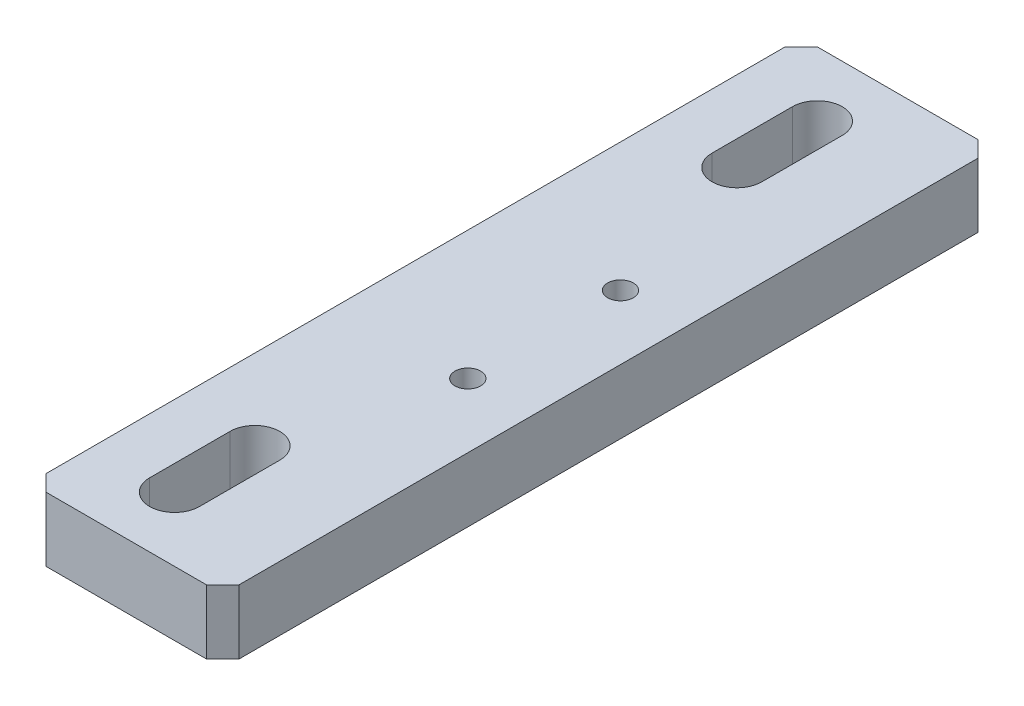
ISO-10303-21;
HEADER;
FILE_DESCRIPTION(('STEP AP214'),'2;1');
FILE_NAME('part.step','',(''),(''),'','','');
FILE_SCHEMA(('AUTOMOTIVE_DESIGN { 1 0 10303 214 1 1 1 1 }'));
ENDSEC;
DATA;
#1=APPLICATION_CONTEXT('core data for automotive mechanical design processes');
#2=APPLICATION_PROTOCOL_DEFINITION('international standard','automotive_design',2000,#1);
#3=PRODUCT_CONTEXT('',#1,'mechanical');
#4=PRODUCT('Part','Part','',(#3));
#5=PRODUCT_RELATED_PRODUCT_CATEGORY('part','',(#4));
#6=PRODUCT_DEFINITION_FORMATION('','',#4);
#7=PRODUCT_DEFINITION_CONTEXT('part definition',#1,'design');
#8=PRODUCT_DEFINITION('design','',#6,#7);
#9=PRODUCT_DEFINITION_SHAPE('','',#8);
#10=(LENGTH_UNIT() NAMED_UNIT(*) SI_UNIT(.MILLI.,.METRE.));
#11=(NAMED_UNIT(*) PLANE_ANGLE_UNIT() SI_UNIT($,.RADIAN.));
#12=(NAMED_UNIT(*) SI_UNIT($,.STERADIAN.) SOLID_ANGLE_UNIT());
#13=UNCERTAINTY_MEASURE_WITH_UNIT(LENGTH_MEASURE(1.E-05),#10,'distance_accuracy_value','');
#14=(GEOMETRIC_REPRESENTATION_CONTEXT(3) GLOBAL_UNCERTAINTY_ASSIGNED_CONTEXT((#13)) GLOBAL_UNIT_ASSIGNED_CONTEXT((#10,
#11,#12)) REPRESENTATION_CONTEXT('',''));
#15=CARTESIAN_POINT('',(0.,0.,0.));
#16=DIRECTION('',(0.,0.,1.));
#17=DIRECTION('',(1.,0.,0.));
#18=AXIS2_PLACEMENT_3D('',#15,#16,#17);
#19=CARTESIAN_POINT('',(0.,4.,0.));
#20=DIRECTION('',(0.,1.,0.));
#21=DIRECTION('',(0.,0.,1.));
#22=AXIS2_PLACEMENT_3D('',#19,#20,#21);
#23=PLANE('',#22);
#24=CARTESIAN_POINT('',(8.,4.,-4.75000000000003));
#25=DIRECTION('',(0.,1.,0.));
#26=DIRECTION('',(0.,0.,1.));
#27=AXIS2_PLACEMENT_3D('',#24,#25,#26);
#28=CIRCLE('',#27,0.799999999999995);
#29=CARTESIAN_POINT('',(8.,4.,-3.95000000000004));
#30=VERTEX_POINT('',#29);
#31=EDGE_CURVE('E523',#30,#30,#28,.T.);
#32=ORIENTED_EDGE('',*,*,#31,.F.);
#33=EDGE_LOOP('',(#32));
#34=FACE_BOUND('',#33,.T.);
#35=CARTESIAN_POINT('',(7.99999999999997,4.,4.74999999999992));
#36=DIRECTION('',(0.,1.,0.));
#37=DIRECTION('',(0.,0.,1.));
#38=AXIS2_PLACEMENT_3D('',#35,#36,#37);
#39=CIRCLE('',#38,0.799999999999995);
#40=CARTESIAN_POINT('',(7.99999999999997,4.,5.54999999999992));
#41=VERTEX_POINT('',#40);
#42=EDGE_CURVE('E519',#41,#41,#39,.T.);
#43=ORIENTED_EDGE('',*,*,#42,.F.);
#44=EDGE_LOOP('',(#43));
#45=FACE_BOUND('',#44,.T.);
#46=DIRECTION('',(0.,0.,-1.));
#47=VECTOR('',#46,1.);
#48=CARTESIAN_POINT('',(12.,4.,-24.));
#49=LINE('',#48,#47);
#50=CARTESIAN_POINT('',(12.,4.,23.));
#51=VERTEX_POINT('',#50);
#52=CARTESIAN_POINT('',(12.,4.,-23.));
#53=VERTEX_POINT('',#52);
#54=EDGE_CURVE('E241',#51,#53,#49,.T.);
#55=ORIENTED_EDGE('',*,*,#54,.T.);
#56=DIRECTION('',(0.707106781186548,0.,0.707106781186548));
#57=VECTOR('',#56,1.);
#58=CARTESIAN_POINT('',(17.5,4.,-17.5000000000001));
#59=LINE('',#58,#57);
#60=CARTESIAN_POINT('',(11.,4.,-24.));
#61=VERTEX_POINT('',#60);
#62=EDGE_CURVE('E279',#53,#61,#59,.F.);
#63=ORIENTED_EDGE('',*,*,#62,.T.);
#64=DIRECTION('',(-1.,0.,0.));
#65=VECTOR('',#64,1.);
#66=CARTESIAN_POINT('',(0.,4.,-24.));
#67=LINE('',#66,#65);
#68=CARTESIAN_POINT('',(0.999999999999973,4.,-24.));
#69=VERTEX_POINT('',#68);
#70=EDGE_CURVE('E244',#61,#69,#67,.T.);
#71=ORIENTED_EDGE('',*,*,#70,.T.);
#72=DIRECTION('',(0.707106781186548,0.,-0.707106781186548));
#73=VECTOR('',#72,1.);
#74=CARTESIAN_POINT('',(-11.5,4.,-11.5));
#75=LINE('',#74,#73);
#76=CARTESIAN_POINT('',(0.,4.,-23.));
#77=VERTEX_POINT('',#76);
#78=EDGE_CURVE('E274',#69,#77,#75,.F.);
#79=ORIENTED_EDGE('',*,*,#78,.T.);
#80=DIRECTION('',(0.,0.,1.));
#81=VECTOR('',#80,1.);
#82=CARTESIAN_POINT('',(0.,4.,-24.));
#83=LINE('',#82,#81);
#84=CARTESIAN_POINT('',(0.,4.,23.));
#85=VERTEX_POINT('',#84);
#86=EDGE_CURVE('E236',#77,#85,#83,.T.);
#87=ORIENTED_EDGE('',*,*,#86,.T.);
#88=DIRECTION('',(-0.707106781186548,0.,-0.707106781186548));
#89=VECTOR('',#88,1.);
#90=CARTESIAN_POINT('',(-11.5,4.,11.5000000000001));
#91=LINE('',#90,#89);
#92=CARTESIAN_POINT('',(0.999999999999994,4.,24.));
#93=VERTEX_POINT('',#92);
#94=EDGE_CURVE('E69',#85,#93,#91,.F.);
#95=ORIENTED_EDGE('',*,*,#94,.T.);
#96=DIRECTION('',(1.,0.,0.));
#97=VECTOR('',#96,1.);
#98=CARTESIAN_POINT('',(0.,4.,24.));
#99=LINE('',#98,#97);
#100=CARTESIAN_POINT('',(11.,4.,24.));
#101=VERTEX_POINT('',#100);
#102=EDGE_CURVE('E238',#93,#101,#99,.T.);
#103=ORIENTED_EDGE('',*,*,#102,.T.);
#104=DIRECTION('',(-0.707106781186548,0.,0.707106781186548));
#105=VECTOR('',#104,1.);
#106=CARTESIAN_POINT('',(17.5,4.,17.5));
#107=LINE('',#106,#105);
#108=EDGE_CURVE('E277',#101,#51,#107,.F.);
#109=ORIENTED_EDGE('',*,*,#108,.T.);
#110=EDGE_LOOP('',(#55,#63,#71,#79,#87,#95,#103,#109));
#111=FACE_BOUND('',#110,.T.);
#112=DIRECTION('',(0.,0.,1.));
#113=VECTOR('',#112,1.);
#114=CARTESIAN_POINT('',(3.44999999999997,4.,-20.));
#115=LINE('',#114,#113);
#116=CARTESIAN_POINT('',(3.44999999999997,4.,-20.));
#117=VERTEX_POINT('',#116);
#118=CARTESIAN_POINT('',(3.44999999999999,4.,-15.));
#119=VERTEX_POINT('',#118);
#120=EDGE_CURVE('E207',#117,#119,#115,.T.);
#121=ORIENTED_EDGE('',*,*,#120,.F.);
#122=CARTESIAN_POINT('',(4.99999999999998,4.,-20.));
#123=DIRECTION('',(0.,1.,0.));
#124=DIRECTION('',(0.,0.,1.));
#125=AXIS2_PLACEMENT_3D('',#122,#123,#124);
#126=CIRCLE('',#125,1.55000000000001);
#127=CARTESIAN_POINT('',(6.54999999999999,4.,-20.));
#128=VERTEX_POINT('',#127);
#129=EDGE_CURVE('E205',#128,#117,#126,.T.);
#130=ORIENTED_EDGE('',*,*,#129,.F.);
#131=DIRECTION('',(0.,0.,-1.));
#132=VECTOR('',#131,1.);
#133=CARTESIAN_POINT('',(6.54999999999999,4.,-20.));
#134=LINE('',#133,#132);
#135=CARTESIAN_POINT('',(6.55000000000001,4.,-15.));
#136=VERTEX_POINT('',#135);
#137=EDGE_CURVE('E213',#136,#128,#134,.T.);
#138=ORIENTED_EDGE('',*,*,#137,.F.);
#139=CARTESIAN_POINT('',(5.,4.,-15.));
#140=DIRECTION('',(0.,1.,0.));
#141=DIRECTION('',(0.,0.,1.));
#142=AXIS2_PLACEMENT_3D('',#139,#140,#141);
#143=CIRCLE('',#142,1.55000000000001);
#144=EDGE_CURVE('E210',#119,#136,#143,.T.);
#145=ORIENTED_EDGE('',*,*,#144,.F.);
#146=EDGE_LOOP('',(#121,#130,#138,#145));
#147=FACE_BOUND('',#146,.T.);
#148=DIRECTION('',(0.,0.,-1.));
#149=VECTOR('',#148,1.);
#150=CARTESIAN_POINT('',(6.54999999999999,4.,20.));
#151=LINE('',#150,#149);
#152=CARTESIAN_POINT('',(6.54999999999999,4.,20.));
#153=VERTEX_POINT('',#152);
#154=CARTESIAN_POINT('',(6.54999999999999,4.,15.));
#155=VERTEX_POINT('',#154);
#156=EDGE_CURVE('E172',#153,#155,#151,.T.);
#157=ORIENTED_EDGE('',*,*,#156,.F.);
#158=CARTESIAN_POINT('',(4.99999999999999,4.,20.));
#159=DIRECTION('',(0.,1.,0.));
#160=DIRECTION('',(0.,0.,-1.));
#161=AXIS2_PLACEMENT_3D('',#158,#159,#160);
#162=CIRCLE('',#161,1.55);
#163=CARTESIAN_POINT('',(3.44999999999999,4.,20.));
#164=VERTEX_POINT('',#163);
#165=EDGE_CURVE('E162',#164,#153,#162,.T.);
#166=ORIENTED_EDGE('',*,*,#165,.F.);
#167=DIRECTION('',(0.,0.,1.));
#168=VECTOR('',#167,1.);
#169=CARTESIAN_POINT('',(3.44999999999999,4.,20.));
#170=LINE('',#169,#168);
#171=CARTESIAN_POINT('',(3.44999999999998,4.,15.));
#172=VERTEX_POINT('',#171);
#173=EDGE_CURVE('E187',#172,#164,#170,.T.);
#174=ORIENTED_EDGE('',*,*,#173,.F.);
#175=CARTESIAN_POINT('',(4.99999999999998,4.,15.));
#176=DIRECTION('',(0.,1.,0.));
#177=DIRECTION('',(0.,0.,-1.));
#178=AXIS2_PLACEMENT_3D('',#175,#176,#177);
#179=CIRCLE('',#178,1.55);
#180=EDGE_CURVE('E185',#155,#172,#179,.T.);
#181=ORIENTED_EDGE('',*,*,#180,.F.);
#182=EDGE_LOOP('',(#157,#166,#174,#181));
#183=FACE_BOUND('',#182,.T.);
#184=ADVANCED_FACE('F47',(#34,#45,#111,#147,#183),#23,.T.);
#185=CARTESIAN_POINT('',(0.,0.,0.));
#186=DIRECTION('',(0.,1.,0.));
#187=DIRECTION('',(0.,0.,1.));
#188=AXIS2_PLACEMENT_3D('',#185,#186,#187);
#189=PLANE('',#188);
#190=CARTESIAN_POINT('',(8.,0.,-4.75000000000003));
#191=DIRECTION('',(0.,1.,0.));
#192=DIRECTION('',(0.,0.,1.));
#193=AXIS2_PLACEMENT_3D('',#190,#191,#192);
#194=CIRCLE('',#193,0.799999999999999);
#195=CARTESIAN_POINT('',(8.,0.,-3.95000000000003));
#196=VERTEX_POINT('',#195);
#197=EDGE_CURVE('E520',#196,#196,#194,.T.);
#198=ORIENTED_EDGE('',*,*,#197,.T.);
#199=EDGE_LOOP('',(#198));
#200=FACE_BOUND('',#199,.T.);
#201=CARTESIAN_POINT('',(7.99999999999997,0.,4.74999999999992));
#202=DIRECTION('',(0.,1.,0.));
#203=DIRECTION('',(0.,0.,1.));
#204=AXIS2_PLACEMENT_3D('',#201,#202,#203);
#205=CIRCLE('',#204,0.799999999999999);
#206=CARTESIAN_POINT('',(7.99999999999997,0.,5.54999999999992));
#207=VERTEX_POINT('',#206);
#208=EDGE_CURVE('E194',#207,#207,#205,.T.);
#209=ORIENTED_EDGE('',*,*,#208,.T.);
#210=EDGE_LOOP('',(#209));
#211=FACE_BOUND('',#210,.T.);
#212=CARTESIAN_POINT('',(4.99999999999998,0.,-20.));
#213=DIRECTION('',(0.,1.,0.));
#214=DIRECTION('',(0.,0.,1.));
#215=AXIS2_PLACEMENT_3D('',#212,#213,#214);
#216=CIRCLE('',#215,1.55000000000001);
#217=CARTESIAN_POINT('',(6.54999999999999,0.,-20.));
#218=VERTEX_POINT('',#217);
#219=CARTESIAN_POINT('',(3.44999999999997,0.,-20.));
#220=VERTEX_POINT('',#219);
#221=EDGE_CURVE('E180',#218,#220,#216,.T.);
#222=ORIENTED_EDGE('',*,*,#221,.T.);
#223=DIRECTION('',(0.,0.,1.));
#224=VECTOR('',#223,1.);
#225=CARTESIAN_POINT('',(3.44999999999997,0.,-20.));
#226=LINE('',#225,#224);
#227=CARTESIAN_POINT('',(3.44999999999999,0.,-15.));
#228=VERTEX_POINT('',#227);
#229=EDGE_CURVE('E218',#220,#228,#226,.T.);
#230=ORIENTED_EDGE('',*,*,#229,.T.);
#231=CARTESIAN_POINT('',(5.,0.,-15.));
#232=DIRECTION('',(0.,1.,0.));
#233=DIRECTION('',(0.,0.,1.));
#234=AXIS2_PLACEMENT_3D('',#231,#232,#233);
#235=CIRCLE('',#234,1.55000000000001);
#236=CARTESIAN_POINT('',(6.55000000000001,0.,-15.));
#237=VERTEX_POINT('',#236);
#238=EDGE_CURVE('E221',#228,#237,#235,.T.);
#239=ORIENTED_EDGE('',*,*,#238,.T.);
#240=DIRECTION('',(0.,0.,-1.));
#241=VECTOR('',#240,1.);
#242=CARTESIAN_POINT('',(6.54999999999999,0.,-20.));
#243=LINE('',#242,#241);
#244=EDGE_CURVE('E208',#237,#218,#243,.T.);
#245=ORIENTED_EDGE('',*,*,#244,.T.);
#246=EDGE_LOOP('',(#222,#230,#239,#245));
#247=FACE_BOUND('',#246,.T.);
#248=DIRECTION('',(-1.,0.,0.));
#249=VECTOR('',#248,1.);
#250=CARTESIAN_POINT('',(0.,0.,-24.));
#251=LINE('',#250,#249);
#252=CARTESIAN_POINT('',(11.,0.,-24.));
#253=VERTEX_POINT('',#252);
#254=CARTESIAN_POINT('',(0.999999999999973,0.,-24.));
#255=VERTEX_POINT('',#254);
#256=EDGE_CURVE('E239',#253,#255,#251,.T.);
#257=ORIENTED_EDGE('',*,*,#256,.F.);
#258=DIRECTION('',(-0.707106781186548,0.,-0.707106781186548));
#259=VECTOR('',#258,1.);
#260=CARTESIAN_POINT('',(11.,0.,-24.));
#261=LINE('',#260,#259);
#262=CARTESIAN_POINT('',(12.,0.,-23.));
#263=VERTEX_POINT('',#262);
#264=EDGE_CURVE('E267',#253,#263,#261,.F.);
#265=ORIENTED_EDGE('',*,*,#264,.T.);
#266=DIRECTION('',(0.,0.,-1.));
#267=VECTOR('',#266,1.);
#268=CARTESIAN_POINT('',(12.,0.,-24.));
#269=LINE('',#268,#267);
#270=CARTESIAN_POINT('',(12.,0.,23.));
#271=VERTEX_POINT('',#270);
#272=EDGE_CURVE('E252',#271,#263,#269,.T.);
#273=ORIENTED_EDGE('',*,*,#272,.F.);
#274=DIRECTION('',(0.707106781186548,0.,-0.707106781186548));
#275=VECTOR('',#274,1.);
#276=CARTESIAN_POINT('',(12.,0.,23.));
#277=LINE('',#276,#275);
#278=CARTESIAN_POINT('',(11.,0.,24.));
#279=VERTEX_POINT('',#278);
#280=EDGE_CURVE('E265',#271,#279,#277,.F.);
#281=ORIENTED_EDGE('',*,*,#280,.T.);
#282=DIRECTION('',(1.,0.,0.));
#283=VECTOR('',#282,1.);
#284=CARTESIAN_POINT('',(0.,0.,24.));
#285=LINE('',#284,#283);
#286=CARTESIAN_POINT('',(0.999999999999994,0.,24.));
#287=VERTEX_POINT('',#286);
#288=EDGE_CURVE('E250',#287,#279,#285,.T.);
#289=ORIENTED_EDGE('',*,*,#288,.F.);
#290=DIRECTION('',(0.707106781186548,0.,0.707106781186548));
#291=VECTOR('',#290,1.);
#292=CARTESIAN_POINT('',(0.999999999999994,0.,24.));
#293=LINE('',#292,#291);
#294=CARTESIAN_POINT('',(0.,0.,23.));
#295=VERTEX_POINT('',#294);
#296=EDGE_CURVE('E263',#287,#295,#293,.F.);
#297=ORIENTED_EDGE('',*,*,#296,.T.);
#298=DIRECTION('',(0.,0.,1.));
#299=VECTOR('',#298,1.);
#300=CARTESIAN_POINT('',(0.,0.,-24.));
#301=LINE('',#300,#299);
#302=CARTESIAN_POINT('',(0.,0.,-23.));
#303=VERTEX_POINT('',#302);
#304=EDGE_CURVE('E235',#303,#295,#301,.T.);
#305=ORIENTED_EDGE('',*,*,#304,.F.);
#306=DIRECTION('',(-0.707106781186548,0.,0.707106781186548));
#307=VECTOR('',#306,1.);
#308=CARTESIAN_POINT('',(0.,0.,-23.));
#309=LINE('',#308,#307);
#310=EDGE_CURVE('E261',#303,#255,#309,.F.);
#311=ORIENTED_EDGE('',*,*,#310,.T.);
#312=EDGE_LOOP('',(#257,#265,#273,#281,#289,#297,#305,#311));
#313=FACE_BOUND('',#312,.T.);
#314=CARTESIAN_POINT('',(4.99999999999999,0.,20.));
#315=DIRECTION('',(0.,1.,0.));
#316=DIRECTION('',(0.,0.,-1.));
#317=AXIS2_PLACEMENT_3D('',#314,#315,#316);
#318=CIRCLE('',#317,1.55);
#319=CARTESIAN_POINT('',(3.44999999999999,0.,20.));
#320=VERTEX_POINT('',#319);
#321=CARTESIAN_POINT('',(6.54999999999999,0.,20.));
#322=VERTEX_POINT('',#321);
#323=EDGE_CURVE('E192',#320,#322,#318,.T.);
#324=ORIENTED_EDGE('',*,*,#323,.T.);
#325=DIRECTION('',(0.,0.,-1.));
#326=VECTOR('',#325,1.);
#327=CARTESIAN_POINT('',(6.54999999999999,0.,20.));
#328=LINE('',#327,#326);
#329=CARTESIAN_POINT('',(6.54999999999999,0.,15.));
#330=VERTEX_POINT('',#329);
#331=EDGE_CURVE('E179',#322,#330,#328,.T.);
#332=ORIENTED_EDGE('',*,*,#331,.T.);
#333=CARTESIAN_POINT('',(4.99999999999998,0.,15.));
#334=DIRECTION('',(0.,1.,0.));
#335=DIRECTION('',(0.,0.,-1.));
#336=AXIS2_PLACEMENT_3D('',#333,#334,#335);
#337=CIRCLE('',#336,1.55);
#338=CARTESIAN_POINT('',(3.44999999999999,0.,15.));
#339=VERTEX_POINT('',#338);
#340=EDGE_CURVE('E196',#330,#339,#337,.T.);
#341=ORIENTED_EDGE('',*,*,#340,.T.);
#342=DIRECTION('',(0.,0.,1.));
#343=VECTOR('',#342,1.);
#344=CARTESIAN_POINT('',(3.44999999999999,0.,20.));
#345=LINE('',#344,#343);
#346=EDGE_CURVE('E173',#339,#320,#345,.T.);
#347=ORIENTED_EDGE('',*,*,#346,.T.);
#348=EDGE_LOOP('',(#324,#332,#341,#347));
#349=FACE_BOUND('',#348,.T.);
#350=ADVANCED_FACE('F295',(#200,#211,#247,#313,#349),#189,.F.);
#351=CARTESIAN_POINT('',(0.,4.,-24.));
#352=DIRECTION('',(1.,0.,0.));
#353=DIRECTION('',(0.,0.,-1.));
#354=AXIS2_PLACEMENT_3D('',#351,#352,#353);
#355=PLANE('',#354);
#356=ORIENTED_EDGE('',*,*,#304,.T.);
#357=DIRECTION('',(0.,1.,0.));
#358=VECTOR('',#357,1.);
#359=CARTESIAN_POINT('',(0.,4.,23.));
#360=LINE('',#359,#358);
#361=EDGE_CURVE('E13',#295,#85,#360,.T.);
#362=ORIENTED_EDGE('',*,*,#361,.T.);
#363=ORIENTED_EDGE('',*,*,#86,.F.);
#364=DIRECTION('',(0.,-1.,0.));
#365=VECTOR('',#364,1.);
#366=CARTESIAN_POINT('',(0.,4.,-23.));
#367=LINE('',#366,#365);
#368=EDGE_CURVE('E55',#77,#303,#367,.T.);
#369=ORIENTED_EDGE('',*,*,#368,.T.);
#370=EDGE_LOOP('',(#356,#362,#363,#369));
#371=FACE_BOUND('',#370,.T.);
#372=ADVANCED_FACE('F289',(#371),#355,.F.);
#373=CARTESIAN_POINT('',(0.,4.,24.));
#374=DIRECTION('',(0.,0.,-1.));
#375=DIRECTION('',(-1.,0.,0.));
#376=AXIS2_PLACEMENT_3D('',#373,#374,#375);
#377=PLANE('',#376);
#378=ORIENTED_EDGE('',*,*,#288,.T.);
#379=DIRECTION('',(0.,1.,0.));
#380=VECTOR('',#379,1.);
#381=CARTESIAN_POINT('',(11.,4.,24.));
#382=LINE('',#381,#380);
#383=EDGE_CURVE('E62',#279,#101,#382,.T.);
#384=ORIENTED_EDGE('',*,*,#383,.T.);
#385=ORIENTED_EDGE('',*,*,#102,.F.);
#386=DIRECTION('',(0.,-1.,0.));
#387=VECTOR('',#386,1.);
#388=CARTESIAN_POINT('',(0.999999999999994,4.,24.));
#389=LINE('',#388,#387);
#390=EDGE_CURVE('E281',#93,#287,#389,.T.);
#391=ORIENTED_EDGE('',*,*,#390,.T.);
#392=EDGE_LOOP('',(#378,#384,#385,#391));
#393=FACE_BOUND('',#392,.T.);
#394=ADVANCED_FACE('F301',(#393),#377,.F.);
#395=CARTESIAN_POINT('',(12.,4.,-24.));
#396=DIRECTION('',(-1.,0.,0.));
#397=DIRECTION('',(0.,0.,1.));
#398=AXIS2_PLACEMENT_3D('',#395,#396,#397);
#399=PLANE('',#398);
#400=ORIENTED_EDGE('',*,*,#272,.T.);
#401=DIRECTION('',(0.,1.,0.));
#402=VECTOR('',#401,1.);
#403=CARTESIAN_POINT('',(12.,4.,-23.));
#404=LINE('',#403,#402);
#405=EDGE_CURVE('E272',#263,#53,#404,.T.);
#406=ORIENTED_EDGE('',*,*,#405,.T.);
#407=ORIENTED_EDGE('',*,*,#54,.F.);
#408=DIRECTION('',(0.,-1.,0.));
#409=VECTOR('',#408,1.);
#410=CARTESIAN_POINT('',(12.,4.,23.));
#411=LINE('',#410,#409);
#412=EDGE_CURVE('E269',#51,#271,#411,.T.);
#413=ORIENTED_EDGE('',*,*,#412,.T.);
#414=EDGE_LOOP('',(#400,#406,#407,#413));
#415=FACE_BOUND('',#414,.T.);
#416=ADVANCED_FACE('F310',(#415),#399,.F.);
#417=CARTESIAN_POINT('',(0.,4.,-24.));
#418=DIRECTION('',(0.,0.,1.));
#419=DIRECTION('',(1.,0.,0.));
#420=AXIS2_PLACEMENT_3D('',#417,#418,#419);
#421=PLANE('',#420);
#422=ORIENTED_EDGE('',*,*,#70,.F.);
#423=DIRECTION('',(0.,-1.,0.));
#424=VECTOR('',#423,1.);
#425=CARTESIAN_POINT('',(11.,4.,-24.));
#426=LINE('',#425,#424);
#427=EDGE_CURVE('E258',#61,#253,#426,.T.);
#428=ORIENTED_EDGE('',*,*,#427,.T.);
#429=ORIENTED_EDGE('',*,*,#256,.T.);
#430=DIRECTION('',(0.,1.,0.));
#431=VECTOR('',#430,1.);
#432=CARTESIAN_POINT('',(0.999999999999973,4.,-24.));
#433=LINE('',#432,#431);
#434=EDGE_CURVE('E247',#255,#69,#433,.T.);
#435=ORIENTED_EDGE('',*,*,#434,.T.);
#436=EDGE_LOOP('',(#422,#428,#429,#435));
#437=FACE_BOUND('',#436,.T.);
#438=ADVANCED_FACE('F318',(#437),#421,.F.);
#439=CARTESIAN_POINT('',(4.99999999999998,4.,-20.));
#440=DIRECTION('',(0.,-1.,0.));
#441=DIRECTION('',(0.,0.,-1.));
#442=AXIS2_PLACEMENT_3D('',#439,#440,#441);
#443=CYLINDRICAL_SURFACE('',#442,1.55000000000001);
#444=ORIENTED_EDGE('',*,*,#221,.F.);
#445=DIRECTION('',(0.,-1.,0.));
#446=VECTOR('',#445,1.);
#447=CARTESIAN_POINT('',(6.54999999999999,4.,-20.));
#448=LINE('',#447,#446);
#449=EDGE_CURVE('E215',#128,#218,#448,.T.);
#450=ORIENTED_EDGE('',*,*,#449,.F.);
#451=ORIENTED_EDGE('',*,*,#129,.T.);
#452=DIRECTION('',(0.,-1.,0.));
#453=VECTOR('',#452,1.);
#454=CARTESIAN_POINT('',(3.44999999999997,4.,-20.));
#455=LINE('',#454,#453);
#456=EDGE_CURVE('E232',#117,#220,#455,.T.);
#457=ORIENTED_EDGE('',*,*,#456,.T.);
#458=EDGE_LOOP('',(#444,#450,#451,#457));
#459=FACE_BOUND('',#458,.T.);
#460=ADVANCED_FACE('F335',(#459),#443,.F.);
#461=CARTESIAN_POINT('',(3.44999999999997,4.,-20.));
#462=DIRECTION('',(1.,0.,0.));
#463=DIRECTION('',(0.,0.,-1.));
#464=AXIS2_PLACEMENT_3D('',#461,#462,#463);
#465=PLANE('',#464);
#466=ORIENTED_EDGE('',*,*,#229,.F.);
#467=ORIENTED_EDGE('',*,*,#456,.F.);
#468=ORIENTED_EDGE('',*,*,#120,.T.);
#469=DIRECTION('',(0.,-1.,0.));
#470=VECTOR('',#469,1.);
#471=CARTESIAN_POINT('',(3.44999999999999,4.,-15.));
#472=LINE('',#471,#470);
#473=EDGE_CURVE('E230',#119,#228,#472,.T.);
#474=ORIENTED_EDGE('',*,*,#473,.T.);
#475=EDGE_LOOP('',(#466,#467,#468,#474));
#476=FACE_BOUND('',#475,.T.);
#477=ADVANCED_FACE('F439',(#476),#465,.T.);
#478=CARTESIAN_POINT('',(5.,4.,-15.));
#479=DIRECTION('',(0.,-1.,0.));
#480=DIRECTION('',(0.,0.,-1.));
#481=AXIS2_PLACEMENT_3D('',#478,#479,#480);
#482=CYLINDRICAL_SURFACE('',#481,1.55000000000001);
#483=ORIENTED_EDGE('',*,*,#238,.F.);
#484=ORIENTED_EDGE('',*,*,#473,.F.);
#485=ORIENTED_EDGE('',*,*,#144,.T.);
#486=DIRECTION('',(0.,-1.,0.));
#487=VECTOR('',#486,1.);
#488=CARTESIAN_POINT('',(6.55000000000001,4.,-15.));
#489=LINE('',#488,#487);
#490=EDGE_CURVE('E228',#136,#237,#489,.T.);
#491=ORIENTED_EDGE('',*,*,#490,.T.);
#492=EDGE_LOOP('',(#483,#484,#485,#491));
#493=FACE_BOUND('',#492,.T.);
#494=ADVANCED_FACE('F430',(#493),#482,.F.);
#495=CARTESIAN_POINT('',(6.54999999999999,4.,-20.));
#496=DIRECTION('',(-1.,0.,0.));
#497=DIRECTION('',(0.,0.,1.));
#498=AXIS2_PLACEMENT_3D('',#495,#496,#497);
#499=PLANE('',#498);
#500=ORIENTED_EDGE('',*,*,#244,.F.);
#501=ORIENTED_EDGE('',*,*,#490,.F.);
#502=ORIENTED_EDGE('',*,*,#137,.T.);
#503=ORIENTED_EDGE('',*,*,#449,.T.);
#504=EDGE_LOOP('',(#500,#501,#502,#503));
#505=FACE_BOUND('',#504,.T.);
#506=ADVANCED_FACE('F422',(#505),#499,.T.);
#507=CARTESIAN_POINT('',(4.99999999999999,4.,20.));
#508=DIRECTION('',(0.,-1.,0.));
#509=DIRECTION('',(0.,0.,-1.));
#510=AXIS2_PLACEMENT_3D('',#507,#508,#509);
#511=CYLINDRICAL_SURFACE('',#510,1.55);
#512=ORIENTED_EDGE('',*,*,#323,.F.);
#513=DIRECTION('',(0.,-1.,0.));
#514=VECTOR('',#513,1.);
#515=CARTESIAN_POINT('',(3.44999999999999,4.,20.));
#516=LINE('',#515,#514);
#517=EDGE_CURVE('E168',#164,#320,#516,.T.);
#518=ORIENTED_EDGE('',*,*,#517,.F.);
#519=ORIENTED_EDGE('',*,*,#165,.T.);
#520=DIRECTION('',(0.,-1.,0.));
#521=VECTOR('',#520,1.);
#522=CARTESIAN_POINT('',(6.54999999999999,4.,20.));
#523=LINE('',#522,#521);
#524=EDGE_CURVE('E165',#153,#322,#523,.T.);
#525=ORIENTED_EDGE('',*,*,#524,.T.);
#526=EDGE_LOOP('',(#512,#518,#519,#525));
#527=FACE_BOUND('',#526,.T.);
#528=ADVANCED_FACE('F164',(#527),#511,.F.);
#529=CARTESIAN_POINT('',(6.54999999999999,4.,20.));
#530=DIRECTION('',(-1.,0.,0.));
#531=DIRECTION('',(0.,0.,1.));
#532=AXIS2_PLACEMENT_3D('',#529,#530,#531);
#533=PLANE('',#532);
#534=ORIENTED_EDGE('',*,*,#331,.F.);
#535=ORIENTED_EDGE('',*,*,#524,.F.);
#536=ORIENTED_EDGE('',*,*,#156,.T.);
#537=DIRECTION('',(0.,-1.,0.));
#538=VECTOR('',#537,1.);
#539=CARTESIAN_POINT('',(6.54999999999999,4.,15.));
#540=LINE('',#539,#538);
#541=EDGE_CURVE('E181',#155,#330,#540,.T.);
#542=ORIENTED_EDGE('',*,*,#541,.T.);
#543=EDGE_LOOP('',(#534,#535,#536,#542));
#544=FACE_BOUND('',#543,.T.);
#545=ADVANCED_FACE('F176',(#544),#533,.T.);
#546=CARTESIAN_POINT('',(4.99999999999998,4.,15.));
#547=DIRECTION('',(0.,-1.,0.));
#548=DIRECTION('',(0.,0.,-1.));
#549=AXIS2_PLACEMENT_3D('',#546,#547,#548);
#550=CYLINDRICAL_SURFACE('',#549,1.55);
#551=ORIENTED_EDGE('',*,*,#340,.F.);
#552=ORIENTED_EDGE('',*,*,#541,.F.);
#553=ORIENTED_EDGE('',*,*,#180,.T.);
#554=DIRECTION('',(0.,-1.,0.));
#555=VECTOR('',#554,1.);
#556=CARTESIAN_POINT('',(3.44999999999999,4.,15.));
#557=LINE('',#556,#555);
#558=EDGE_CURVE('E202',#172,#339,#557,.T.);
#559=ORIENTED_EDGE('',*,*,#558,.T.);
#560=EDGE_LOOP('',(#551,#552,#553,#559));
#561=FACE_BOUND('',#560,.T.);
#562=ADVANCED_FACE('F398',(#561),#550,.F.);
#563=CARTESIAN_POINT('',(3.44999999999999,4.,20.));
#564=DIRECTION('',(1.,0.,0.));
#565=DIRECTION('',(0.,0.,-1.));
#566=AXIS2_PLACEMENT_3D('',#563,#564,#565);
#567=PLANE('',#566);
#568=ORIENTED_EDGE('',*,*,#346,.F.);
#569=ORIENTED_EDGE('',*,*,#558,.F.);
#570=ORIENTED_EDGE('',*,*,#173,.T.);
#571=ORIENTED_EDGE('',*,*,#517,.T.);
#572=EDGE_LOOP('',(#568,#569,#570,#571));
#573=FACE_BOUND('',#572,.T.);
#574=ADVANCED_FACE('F388',(#573),#567,.T.);
#575=CARTESIAN_POINT('',(7.99999999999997,4.,4.74999999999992));
#576=DIRECTION('',(0.,1.,0.));
#577=DIRECTION('',(0.,0.,1.));
#578=AXIS2_PLACEMENT_3D('',#575,#576,#577);
#579=CYLINDRICAL_SURFACE('',#578,0.799999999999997);
#580=ORIENTED_EDGE('',*,*,#208,.F.);
#581=EDGE_LOOP('',(#580));
#582=FACE_BOUND('',#581,.T.);
#583=ORIENTED_EDGE('',*,*,#42,.T.);
#584=EDGE_LOOP('',(#583));
#585=FACE_BOUND('',#584,.T.);
#586=ADVANCED_FACE('F379',(#582,#585),#579,.F.);
#587=CARTESIAN_POINT('',(8.,4.,-4.75000000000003));
#588=DIRECTION('',(0.,1.,0.));
#589=DIRECTION('',(0.,0.,1.));
#590=AXIS2_PLACEMENT_3D('',#587,#588,#589);
#591=CYLINDRICAL_SURFACE('',#590,0.799999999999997);
#592=ORIENTED_EDGE('',*,*,#197,.F.);
#593=EDGE_LOOP('',(#592));
#594=FACE_BOUND('',#593,.T.);
#595=ORIENTED_EDGE('',*,*,#31,.T.);
#596=EDGE_LOOP('',(#595));
#597=FACE_BOUND('',#596,.T.);
#598=ADVANCED_FACE('F348',(#594,#597),#591,.F.);
#599=CARTESIAN_POINT('',(11.,4.,-24.));
#600=DIRECTION('',(-0.707106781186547,0.,0.707106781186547));
#601=DIRECTION('',(0.,-1.,0.));
#602=AXIS2_PLACEMENT_3D('',#599,#600,#601);
#603=PLANE('',#602);
#604=ORIENTED_EDGE('',*,*,#62,.F.);
#605=ORIENTED_EDGE('',*,*,#405,.F.);
#606=ORIENTED_EDGE('',*,*,#264,.F.);
#607=ORIENTED_EDGE('',*,*,#427,.F.);
#608=EDGE_LOOP('',(#604,#605,#606,#607));
#609=FACE_BOUND('',#608,.T.);
#610=ADVANCED_FACE('F315',(#609),#603,.F.);
#611=CARTESIAN_POINT('',(12.,4.,23.));
#612=DIRECTION('',(-0.707106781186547,0.,-0.707106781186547));
#613=DIRECTION('',(0.,-1.,0.));
#614=AXIS2_PLACEMENT_3D('',#611,#612,#613);
#615=PLANE('',#614);
#616=ORIENTED_EDGE('',*,*,#108,.F.);
#617=ORIENTED_EDGE('',*,*,#383,.F.);
#618=ORIENTED_EDGE('',*,*,#280,.F.);
#619=ORIENTED_EDGE('',*,*,#412,.F.);
#620=EDGE_LOOP('',(#616,#617,#618,#619));
#621=FACE_BOUND('',#620,.T.);
#622=ADVANCED_FACE('F307',(#621),#615,.F.);
#623=CARTESIAN_POINT('',(0.999999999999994,4.,24.));
#624=DIRECTION('',(0.707106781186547,0.,-0.707106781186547));
#625=DIRECTION('',(0.,-1.,0.));
#626=AXIS2_PLACEMENT_3D('',#623,#624,#625);
#627=PLANE('',#626);
#628=ORIENTED_EDGE('',*,*,#94,.F.);
#629=ORIENTED_EDGE('',*,*,#361,.F.);
#630=ORIENTED_EDGE('',*,*,#296,.F.);
#631=ORIENTED_EDGE('',*,*,#390,.F.);
#632=EDGE_LOOP('',(#628,#629,#630,#631));
#633=FACE_BOUND('',#632,.T.);
#634=ADVANCED_FACE('F300',(#633),#627,.F.);
#635=CARTESIAN_POINT('',(0.,4.,-23.));
#636=DIRECTION('',(0.707106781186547,0.,0.707106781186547));
#637=DIRECTION('',(0.,-1.,0.));
#638=AXIS2_PLACEMENT_3D('',#635,#636,#637);
#639=PLANE('',#638);
#640=ORIENTED_EDGE('',*,*,#78,.F.);
#641=ORIENTED_EDGE('',*,*,#434,.F.);
#642=ORIENTED_EDGE('',*,*,#310,.F.);
#643=ORIENTED_EDGE('',*,*,#368,.F.);
#644=EDGE_LOOP('',(#640,#641,#642,#643));
#645=FACE_BOUND('',#644,.T.);
#646=ADVANCED_FACE('F49',(#645),#639,.F.);
#647=CLOSED_SHELL('',(#184,#350,#372,#394,#416,#438,#460,#477,#494,#506,#528,#545,#562,#574,
#586,#598,#610,#622,#634,#646));
#648=MANIFOLD_SOLID_BREP('B2',#647);
#649=ADVANCED_BREP_SHAPE_REPRESENTATION('',(#18,#648),#14);
#650=SHAPE_DEFINITION_REPRESENTATION(#9,#649);
ENDSEC;
END-ISO-10303-21;
